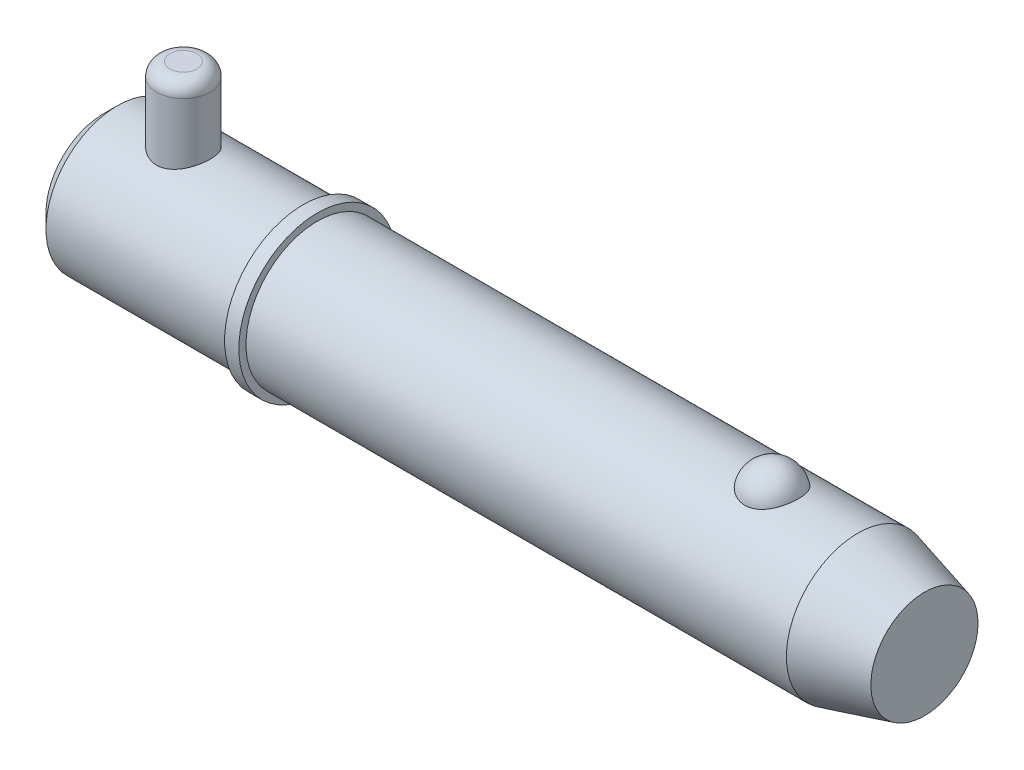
ISO-10303-21;
HEADER;
FILE_DESCRIPTION(('STEP AP214'),'2;1');
FILE_NAME('part.step','',(''),(''),'','','');
FILE_SCHEMA(('AUTOMOTIVE_DESIGN { 1 0 10303 214 1 1 1 1 }'));
ENDSEC;
DATA;
#1=APPLICATION_CONTEXT('core data for automotive mechanical design processes');
#2=APPLICATION_PROTOCOL_DEFINITION('international standard','automotive_design',2000,#1);
#3=PRODUCT_CONTEXT('',#1,'mechanical');
#4=PRODUCT('Part','Part','',(#3));
#5=PRODUCT_RELATED_PRODUCT_CATEGORY('part','',(#4));
#6=PRODUCT_DEFINITION_FORMATION('','',#4);
#7=PRODUCT_DEFINITION_CONTEXT('part definition',#1,'design');
#8=PRODUCT_DEFINITION('design','',#6,#7);
#9=PRODUCT_DEFINITION_SHAPE('','',#8);
#10=(LENGTH_UNIT() NAMED_UNIT(*) SI_UNIT(.MILLI.,.METRE.));
#11=(NAMED_UNIT(*) PLANE_ANGLE_UNIT() SI_UNIT($,.RADIAN.));
#12=(NAMED_UNIT(*) SI_UNIT($,.STERADIAN.) SOLID_ANGLE_UNIT());
#13=UNCERTAINTY_MEASURE_WITH_UNIT(LENGTH_MEASURE(1.E-05),#10,'distance_accuracy_value','');
#14=(GEOMETRIC_REPRESENTATION_CONTEXT(3) GLOBAL_UNCERTAINTY_ASSIGNED_CONTEXT((#13)) GLOBAL_UNIT_ASSIGNED_CONTEXT((#10,
#11,#12)) REPRESENTATION_CONTEXT('',''));
#15=CARTESIAN_POINT('',(0.,0.,0.));
#16=DIRECTION('',(0.,0.,1.));
#17=DIRECTION('',(1.,0.,0.));
#18=AXIS2_PLACEMENT_3D('',#15,#16,#17);
#19=CARTESIAN_POINT('',(14.28,25.4,0.));
#20=DIRECTION('',(0.,-1.,0.));
#21=DIRECTION('',(0.,0.,-1.));
#22=AXIS2_PLACEMENT_3D('',#19,#20,#21);
#23=CYLINDRICAL_SURFACE('',#22,4.76);
#24=CARTESIAN_POINT('',(14.28,-10.32,0.));
#25=DIRECTION('',(0.,1.,0.));
#26=DIRECTION('',(0.,0.,1.));
#27=AXIS2_PLACEMENT_3D('',#24,#25,#26);
#28=CIRCLE('',#27,4.76);
#29=CARTESIAN_POINT('',(14.28,-10.32,-4.76));
#30=VERTEX_POINT('',#29);
#31=EDGE_CURVE('P0_E25',#30,#30,#28,.T.);
#32=CARTESIAN_POINT('',(14.28,23.02,0.));
#33=DIRECTION('',(0.,1.,0.));
#34=DIRECTION('',(0.,0.,1.));
#35=AXIS2_PLACEMENT_3D('',#32,#33,#34);
#36=CIRCLE('',#35,4.76);
#37=CARTESIAN_POINT('',(14.28,23.02,-4.76));
#38=VERTEX_POINT('',#37);
#39=EDGE_CURVE('P0_E29',#38,#38,#36,.F.);
#40=CARTESIAN_POINT('',(14.28,-10.32,-4.76));
#41=CARTESIAN_POINT('',(14.28,-9.97270833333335,-4.76));
#42=CARTESIAN_POINT('',(14.28,-9.62541666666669,-4.76));
#43=CARTESIAN_POINT('',(14.28,-8.93083333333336,-4.76));
#44=CARTESIAN_POINT('',(14.28,-8.58354166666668,-4.76));
#45=CARTESIAN_POINT('',(14.28,-7.88895833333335,-4.76));
#46=CARTESIAN_POINT('',(14.28,-7.54166666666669,-4.76));
#47=CARTESIAN_POINT('',(14.28,-6.84708333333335,-4.76));
#48=CARTESIAN_POINT('',(14.28,-6.49979166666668,-4.76));
#49=CARTESIAN_POINT('',(14.28,-5.80520833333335,-4.76));
#50=CARTESIAN_POINT('',(14.28,-5.45791666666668,-4.76));
#51=CARTESIAN_POINT('',(14.28,-4.76333333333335,-4.76));
#52=CARTESIAN_POINT('',(14.28,-4.41604166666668,-4.76));
#53=CARTESIAN_POINT('',(14.28,-3.72145833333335,-4.76));
#54=CARTESIAN_POINT('',(14.28,-3.37416666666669,-4.76));
#55=CARTESIAN_POINT('',(14.28,-2.67958333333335,-4.76));
#56=CARTESIAN_POINT('',(14.28,-2.33229166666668,-4.76));
#57=CARTESIAN_POINT('',(14.28,-1.63770833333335,-4.76));
#58=CARTESIAN_POINT('',(14.28,-1.29041666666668,-4.76));
#59=CARTESIAN_POINT('',(14.28,-0.595833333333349,-4.76));
#60=CARTESIAN_POINT('',(14.28,-0.24854166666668,-4.76));
#61=CARTESIAN_POINT('',(14.28,0.446041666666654,-4.76));
#62=CARTESIAN_POINT('',(14.28,0.793333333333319,-4.76));
#63=CARTESIAN_POINT('',(14.28,1.48791666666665,-4.76));
#64=CARTESIAN_POINT('',(14.28,1.83520833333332,-4.76));
#65=CARTESIAN_POINT('',(14.28,2.52979166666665,-4.76));
#66=CARTESIAN_POINT('',(14.28,2.87708333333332,-4.76));
#67=CARTESIAN_POINT('',(14.28,3.57166666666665,-4.76));
#68=CARTESIAN_POINT('',(14.28,3.91895833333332,-4.76));
#69=CARTESIAN_POINT('',(14.28,4.61354166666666,-4.76));
#70=CARTESIAN_POINT('',(14.28,4.96083333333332,-4.76));
#71=CARTESIAN_POINT('',(14.28,5.65541666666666,-4.76));
#72=CARTESIAN_POINT('',(14.28,6.00270833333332,-4.76));
#73=CARTESIAN_POINT('',(14.28,6.69729166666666,-4.76));
#74=CARTESIAN_POINT('',(14.28,7.04458333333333,-4.76));
#75=CARTESIAN_POINT('',(14.28,7.73916666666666,-4.76));
#76=CARTESIAN_POINT('',(14.28,8.08645833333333,-4.76));
#77=CARTESIAN_POINT('',(14.28,8.78104166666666,-4.76));
#78=CARTESIAN_POINT('',(14.28,9.12833333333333,-4.76));
#79=CARTESIAN_POINT('',(14.28,9.82291666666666,-4.76));
#80=CARTESIAN_POINT('',(14.28,10.1702083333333,-4.76));
#81=CARTESIAN_POINT('',(14.28,10.8647916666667,-4.76));
#82=CARTESIAN_POINT('',(14.28,11.2120833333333,-4.76));
#83=CARTESIAN_POINT('',(14.28,11.9066666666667,-4.76));
#84=CARTESIAN_POINT('',(14.28,12.2539583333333,-4.76));
#85=CARTESIAN_POINT('',(14.28,12.9485416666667,-4.76));
#86=CARTESIAN_POINT('',(14.28,13.2958333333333,-4.76));
#87=CARTESIAN_POINT('',(14.28,13.9904166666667,-4.76));
#88=CARTESIAN_POINT('',(14.28,14.3377083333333,-4.76));
#89=CARTESIAN_POINT('',(14.28,15.0322916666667,-4.76));
#90=CARTESIAN_POINT('',(14.28,15.3795833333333,-4.76));
#91=CARTESIAN_POINT('',(14.28,16.0741666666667,-4.76));
#92=CARTESIAN_POINT('',(14.28,16.4214583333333,-4.76));
#93=CARTESIAN_POINT('',(14.28,17.1160416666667,-4.76));
#94=CARTESIAN_POINT('',(14.28,17.4633333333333,-4.76));
#95=CARTESIAN_POINT('',(14.28,18.1579166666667,-4.76));
#96=CARTESIAN_POINT('',(14.28,18.5052083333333,-4.76));
#97=CARTESIAN_POINT('',(14.28,19.1997916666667,-4.76));
#98=CARTESIAN_POINT('',(14.28,19.5470833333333,-4.76));
#99=CARTESIAN_POINT('',(14.28,20.2416666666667,-4.76));
#100=CARTESIAN_POINT('',(14.28,20.5889583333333,-4.76));
#101=CARTESIAN_POINT('',(14.28,21.2835416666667,-4.76));
#102=CARTESIAN_POINT('',(14.28,21.6308333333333,-4.76));
#103=CARTESIAN_POINT('',(14.28,22.3254166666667,-4.76));
#104=CARTESIAN_POINT('',(14.28,22.6727083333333,-4.76));
#105=CARTESIAN_POINT('',(14.28,23.02,-4.76));
#106=B_SPLINE_CURVE_WITH_KNOTS('',3,(#40,#41,#42,#43,#44,#45,#46,#47,#48,#49,#50,#51,#52,#53,
#54,#55,#56,#57,#58,#59,#60,#61,#62,#63,#64,#65,#66,#67,#68,#69,#70,#71,#72,#73,#74,#75,#76,#77,
#78,#79,#80,#81,#82,#83,#84,#85,#86,#87,#88,#89,#90,#91,#92,#93,#94,#95,#96,#97,#98,#99,#100,
#101,#102,#103,#104,#105),.UNSPECIFIED.,.F.,.F.,(4,2,2,2,2,2,2,2,2,2,2,2,2,2,2,2,2,2,2,2,2,2,2,
2,2,2,2,2,2,2,2,2,4),(0.,1.041875,2.08375,3.125625,4.1675,5.209375,6.25125,7.293125,
8.33500000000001,9.376875,10.41875,11.460625,12.5025,13.544375,14.58625,15.628125,16.67,
17.711875,18.75375,19.795625,20.8375,21.879375,22.92125,23.963125,25.005,26.046875,27.08875,
28.130625,29.1725,30.214375,31.25625,32.298125,33.34),.UNSPECIFIED.);
#107=EDGE_CURVE('P0_BSEAM14',#30,#38,#106,.T.);
#108=ORIENTED_EDGE('',*,*,#31,.T.);
#109=ORIENTED_EDGE('',*,*,#39,.T.);
#110=ORIENTED_EDGE('',*,*,#107,.T.);
#111=ORIENTED_EDGE('',*,*,#107,.F.);
#112=EDGE_LOOP('',(#108,#110,#109,#111));
#113=FACE_BOUND('',#112,.T.);
#114=ADVANCED_FACE('P0_F14',(#113),#23,.T.);
#115=CARTESIAN_POINT('',(14.28,25.4,0.));
#116=DIRECTION('',(0.,1.,0.));
#117=DIRECTION('',(0.,0.,1.));
#118=AXIS2_PLACEMENT_3D('',#115,#116,#117);
#119=PLANE('',#118);
#120=CARTESIAN_POINT('',(14.28,25.4,0.));
#121=DIRECTION('',(0.,1.,0.));
#122=DIRECTION('',(0.,0.,1.));
#123=AXIS2_PLACEMENT_3D('',#120,#121,#122);
#124=CIRCLE('',#123,2.38);
#125=CARTESIAN_POINT('',(14.28,25.4,2.38));
#126=VERTEX_POINT('',#125);
#127=EDGE_CURVE('P0_E10',#126,#126,#124,.T.);
#128=ORIENTED_EDGE('',*,*,#127,.T.);
#129=EDGE_LOOP('',(#128));
#130=FACE_BOUND('',#129,.T.);
#131=ADVANCED_FACE('P0_F46',(#130),#119,.T.);
#132=CARTESIAN_POINT('',(14.28,-12.7,0.));
#133=DIRECTION('',(0.,1.,0.));
#134=DIRECTION('',(0.,0.,1.));
#135=AXIS2_PLACEMENT_3D('',#132,#133,#134);
#136=PLANE('',#135);
#137=CARTESIAN_POINT('',(14.28,-12.7,0.));
#138=DIRECTION('',(0.,1.,0.));
#139=DIRECTION('',(0.,0.,1.));
#140=AXIS2_PLACEMENT_3D('',#137,#138,#139);
#141=CIRCLE('',#140,2.38);
#142=CARTESIAN_POINT('',(14.28,-12.7,2.38));
#143=VERTEX_POINT('',#142);
#144=EDGE_CURVE('P0_E21',#143,#143,#141,.F.);
#145=ORIENTED_EDGE('',*,*,#144,.T.);
#146=EDGE_LOOP('',(#145));
#147=FACE_BOUND('',#146,.T.);
#148=ADVANCED_FACE('P0_F43',(#147),#136,.F.);
#149=CARTESIAN_POINT('',(14.28,-10.32,0.));
#150=DIRECTION('',(0.,1.,0.));
#151=DIRECTION('',(0.,0.,1.));
#152=AXIS2_PLACEMENT_3D('',#149,#150,#151);
#153=DEGENERATE_TOROIDAL_SURFACE('',#152,2.38,2.38,.T.);
#154=ORIENTED_EDGE('',*,*,#144,.F.);
#155=EDGE_LOOP('',(#154));
#156=FACE_BOUND('',#155,.T.);
#157=ORIENTED_EDGE('',*,*,#31,.F.);
#158=EDGE_LOOP('',(#157));
#159=FACE_BOUND('',#158,.T.);
#160=ADVANCED_FACE('P0_F38',(#156,#159),#153,.T.);
#161=CARTESIAN_POINT('',(14.28,23.02,0.));
#162=DIRECTION('',(0.,1.,0.));
#163=DIRECTION('',(0.,0.,1.));
#164=AXIS2_PLACEMENT_3D('',#161,#162,#163);
#165=DEGENERATE_TOROIDAL_SURFACE('',#164,2.38,2.38,.T.);
#166=ORIENTED_EDGE('',*,*,#39,.F.);
#167=EDGE_LOOP('',(#166));
#168=FACE_BOUND('',#167,.T.);
#169=ORIENTED_EDGE('',*,*,#127,.F.);
#170=EDGE_LOOP('',(#169));
#171=FACE_BOUND('',#170,.T.);
#172=ADVANCED_FACE('P0_F16',(#168,#171),#165,.T.);
#173=CLOSED_SHELL('',(#114,#131,#148,#160,#172));
#174=MANIFOLD_SOLID_BREP('P0_B1',#173);
#175=CARTESIAN_POINT('',(0.,0.,0.));
#176=DIRECTION('',(1.,0.,0.));
#177=DIRECTION('',(0.,0.,-1.));
#178=AXIS2_PLACEMENT_3D('',#175,#176,#177);
#179=CYLINDRICAL_SURFACE('',#178,12.7);
#180=CARTESIAN_POINT('',(134.200738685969,0.,0.));
#181=DIRECTION('',(1.,0.,0.));
#182=DIRECTION('',(0.,0.,-1.));
#183=AXIS2_PLACEMENT_3D('',#180,#181,#182);
#184=CIRCLE('',#183,12.7);
#185=CARTESIAN_POINT('',(134.200738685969,0.,-12.7));
#186=VERTEX_POINT('',#185);
#187=EDGE_CURVE('P1_E81',#186,#186,#184,.T.);
#188=ORIENTED_EDGE('',*,*,#187,.F.);
#189=EDGE_LOOP('',(#188));
#190=FACE_BOUND('',#189,.T.);
#191=CARTESIAN_POINT('',(38.1,0.,0.));
#192=DIRECTION('',(1.,0.,0.));
#193=DIRECTION('',(0.,0.,-1.));
#194=AXIS2_PLACEMENT_3D('',#191,#192,#193);
#195=CIRCLE('',#194,12.7);
#196=CARTESIAN_POINT('',(38.1,0.,-12.7));
#197=VERTEX_POINT('',#196);
#198=EDGE_CURVE('P1_E85',#197,#197,#195,.T.);
#199=ORIENTED_EDGE('',*,*,#198,.T.);
#200=EDGE_LOOP('',(#199));
#201=FACE_BOUND('',#200,.T.);
#202=CARTESIAN_POINT('',(118.960042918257,11.7500437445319,4.81938502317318));
#203=CARTESIAN_POINT('',(118.835088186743,11.7500430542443,4.81938571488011));
#204=CARTESIAN_POINT('',(118.710144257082,11.7520975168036,4.81438658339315));
#205=CARTESIAN_POINT('',(118.461142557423,11.760253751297,4.79442904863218));
#206=CARTESIAN_POINT('',(118.337085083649,11.7663568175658,4.77946746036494));
#207=CARTESIAN_POINT('',(118.090901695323,11.7824262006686,4.7397141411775));
#208=CARTESIAN_POINT('',(117.968774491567,11.7923898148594,4.71492928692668));
#209=CARTESIAN_POINT('',(117.727187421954,11.8158938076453,4.65571340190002));
#210=CARTESIAN_POINT('',(117.60772859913,11.8294355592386,4.6212786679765));
#211=CARTESIAN_POINT('',(117.372557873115,11.8596812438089,4.54309502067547));
#212=CARTESIAN_POINT('',(117.256839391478,11.8763792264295,4.49936361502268));
#213=CARTESIAN_POINT('',(117.029653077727,11.9124878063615,4.40287235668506));
#214=CARTESIAN_POINT('',(116.918186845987,11.9318994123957,4.35010914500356));
#215=CARTESIAN_POINT('',(116.591278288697,11.9934256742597,4.17881316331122));
#216=CARTESIAN_POINT('',(116.383127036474,12.038858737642,4.04720756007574));
#217=CARTESIAN_POINT('',(115.985850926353,12.1352173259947,3.748564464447));
#218=CARTESIAN_POINT('',(115.797443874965,12.1862630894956,3.58061821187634));
#219=CARTESIAN_POINT('',(115.450521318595,12.2875163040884,3.21600758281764));
#220=CARTESIAN_POINT('',(115.292011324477,12.3377235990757,3.0193379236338));
#221=CARTESIAN_POINT('',(115.00168878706,12.434492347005,2.592916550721));
#222=CARTESIAN_POINT('',(114.871376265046,12.4807925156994,2.36208286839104));
#223=CARTESIAN_POINT('',(114.649407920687,12.5623454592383,1.88070399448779));
#224=CARTESIAN_POINT('',(114.557755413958,12.5975972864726,1.63015711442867));
#225=CARTESIAN_POINT('',(114.414046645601,12.6538414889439,1.1129886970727));
#226=CARTESIAN_POINT('',(114.362499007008,12.6746503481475,0.846205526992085));
#227=CARTESIAN_POINT('',(114.301977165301,12.699153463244,0.307085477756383));
#228=CARTESIAN_POINT('',(114.293001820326,12.7028481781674,0.0347487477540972));
#229=CARTESIAN_POINT('',(114.317731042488,12.6927785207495,-0.506073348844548));
#230=CARTESIAN_POINT('',(114.351189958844,12.6791146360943,-0.77457186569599));
#231=CARTESIAN_POINT('',(114.459687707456,12.635882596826,-1.30170246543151));
#232=CARTESIAN_POINT('',(114.53472729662,12.606314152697,-1.5603343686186));
#233=CARTESIAN_POINT('',(114.72500006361,12.5342328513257,-2.06083899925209));
#234=CARTESIAN_POINT('',(114.840287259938,12.4917026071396,-2.3026886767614));
#235=CARTESIAN_POINT('',(115.108704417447,12.3981123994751,-2.76259600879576));
#236=CARTESIAN_POINT('',(115.261837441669,12.3470517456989,-2.98065173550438));
#237=CARTESIAN_POINT('',(115.603507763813,12.2416045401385,-3.38786328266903));
#238=CARTESIAN_POINT('',(115.792201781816,12.1872040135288,-3.57688418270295));
#239=CARTESIAN_POINT('',(116.200239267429,12.0814086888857,-3.91941073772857));
#240=CARTESIAN_POINT('',(116.419580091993,12.0300136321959,-4.07291945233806));
#241=CARTESIAN_POINT('',(116.878375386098,11.9373542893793,-4.33691289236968));
#242=CARTESIAN_POINT('',(117.117304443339,11.8958982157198,-4.44824125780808));
#243=CARTESIAN_POINT('',(117.61243761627,11.8268116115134,-4.62881985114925));
#244=CARTESIAN_POINT('',(117.868635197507,11.7991758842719,-4.69808589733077));
#245=CARTESIAN_POINT('',(118.377164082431,11.7622209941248,-4.78983181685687));
#246=CARTESIAN_POINT('',(118.629041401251,11.7520502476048,-4.81449025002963));
#247=CARTESIAN_POINT('',(119.133573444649,11.7485796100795,-4.82295735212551));
#248=CARTESIAN_POINT('',(119.386228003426,11.7552763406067,-4.80677420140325));
#249=CARTESIAN_POINT('',(119.876834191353,11.7842584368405,-4.73525430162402));
#250=CARTESIAN_POINT('',(120.114998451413,11.8060486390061,-4.68116061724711));
#251=CARTESIAN_POINT('',(120.578489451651,11.8622750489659,-4.53678133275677));
#252=CARTESIAN_POINT('',(120.803815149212,11.8967122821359,-4.44649279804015));
#253=CARTESIAN_POINT('',(121.240801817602,11.9754603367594,-4.2298761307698));
#254=CARTESIAN_POINT('',(121.452057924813,12.0199699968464,-4.10280539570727));
#255=CARTESIAN_POINT('',(121.850601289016,12.1138028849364,-3.81685409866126));
#256=CARTESIAN_POINT('',(122.037883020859,12.163127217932,-3.65796622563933));
#257=CARTESIAN_POINT('',(122.393350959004,12.2642343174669,-3.30364864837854));
#258=CARTESIAN_POINT('',(122.560111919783,12.3160165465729,-3.10678783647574));
#259=CARTESIAN_POINT('',(122.859579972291,12.4142566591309,-2.68748409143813));
#260=CARTESIAN_POINT('',(122.992280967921,12.4607135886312,-2.46503658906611));
#261=CARTESIAN_POINT('',(123.224691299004,12.5450236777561,-1.99289519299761));
#262=CARTESIAN_POINT('',(123.323215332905,12.5825557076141,-1.74255918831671));
#263=CARTESIAN_POINT('',(123.479227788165,12.6431720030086,-1.22773734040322));
#264=CARTESIAN_POINT('',(123.536715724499,12.6662560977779,-0.963251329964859));
#265=CARTESIAN_POINT('',(123.609544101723,12.6956486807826,-0.427355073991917));
#266=CARTESIAN_POINT('',(123.624837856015,12.7019385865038,-0.1559374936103));
#267=CARTESIAN_POINT('',(123.612779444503,12.6970201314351,0.385928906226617));
#268=CARTESIAN_POINT('',(123.58542805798,12.6858120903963,0.656377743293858));
#269=CARTESIAN_POINT('',(123.513060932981,12.6568455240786,1.05454017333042));
#270=CARTESIAN_POINT('',(123.483796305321,12.6451962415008,1.18577850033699));
#271=CARTESIAN_POINT('',(123.415022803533,12.6181819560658,1.4451380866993));
#272=CARTESIAN_POINT('',(123.375517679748,12.6028183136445,1.57326046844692));
#273=CARTESIAN_POINT('',(123.286439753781,12.5687547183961,1.82554978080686));
#274=CARTESIAN_POINT('',(123.236862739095,12.5500533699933,1.9497150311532));
#275=CARTESIAN_POINT('',(123.12792115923,12.5098093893,2.1931437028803));
#276=CARTESIAN_POINT('',(123.068560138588,12.4882677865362,2.31240887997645));
#277=CARTESIAN_POINT('',(122.93997128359,12.4427679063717,2.54593031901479));
#278=CARTESIAN_POINT('',(122.870688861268,12.4187964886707,2.66015396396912));
#279=CARTESIAN_POINT('',(122.722903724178,12.3691892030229,2.88202659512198));
#280=CARTESIAN_POINT('',(122.644404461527,12.3435539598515,2.98967802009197));
#281=CARTESIAN_POINT('',(122.478550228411,12.2912955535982,3.19774385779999));
#282=CARTESIAN_POINT('',(122.391191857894,12.2646720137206,3.29815546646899));
#283=CARTESIAN_POINT('',(122.208161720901,12.2111945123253,3.49095035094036));
#284=CARTESIAN_POINT('',(122.112493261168,12.1843406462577,3.58333679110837));
#285=CARTESIAN_POINT('',(121.913627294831,12.1312249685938,3.75922876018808));
#286=CARTESIAN_POINT('',(121.810450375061,12.104961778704,3.84275713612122));
#287=CARTESIAN_POINT('',(121.59701336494,12.0537284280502,4.00056406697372));
#288=CARTESIAN_POINT('',(121.486756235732,12.028757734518,4.07484645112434));
#289=CARTESIAN_POINT('',(121.259755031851,11.9808306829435,4.21367959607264));
#290=CARTESIAN_POINT('',(121.143006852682,11.9578756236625,4.27822410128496));
#291=CARTESIAN_POINT('',(120.90394258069,11.9147184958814,4.39698483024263));
#292=CARTESIAN_POINT('',(120.781628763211,11.894515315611,4.45120522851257));
#293=CARTESIAN_POINT('',(120.522952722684,11.8561129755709,4.55255353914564));
#294=CARTESIAN_POINT('',(120.386223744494,11.8381764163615,4.59884858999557));
#295=CARTESIAN_POINT('',(120.108608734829,11.8069093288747,4.67853897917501));
#296=CARTESIAN_POINT('',(119.967724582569,11.7935767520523,4.71194005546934));
#297=CARTESIAN_POINT('',(119.68309446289,11.7720277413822,4.76552188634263));
#298=CARTESIAN_POINT('',(119.539348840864,11.7638106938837,4.78570422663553));
#299=CARTESIAN_POINT('',(119.250411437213,11.7528195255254,4.81263433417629));
#300=CARTESIAN_POINT('',(119.105219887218,11.7500445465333,4.81938421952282));
#301=CARTESIAN_POINT('',(118.960042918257,11.7500437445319,4.81938502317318));
#302=B_SPLINE_CURVE_WITH_KNOTS('',3,(#202,#203,#204,#205,#206,#207,#208,#209,#210,#211,#212,
#213,#214,#215,#216,#217,#218,#219,#220,#221,#222,#223,#224,#225,#226,#227,#228,#229,#230,#231,
#232,#233,#234,#235,#236,#237,#238,#239,#240,#241,#242,#243,#244,#245,#246,#247,#248,#249,#250,
#251,#252,#253,#254,#255,#256,#257,#258,#259,#260,#261,#262,#263,#264,#265,#266,#267,#268,#269,
#270,#271,#272,#273,#274,#275,#276,#277,#278,#279,#280,#281,#282,#283,#284,#285,#286,#287,#288,
#289,#290,#291,#292,#293,#294,#295,#296,#297,#298,#299,#300,#301),.UNSPECIFIED.,.T.,.F.,(4,2,2,
2,2,2,2,2,2,2,2,2,2,2,2,2,2,2,2,2,2,2,2,2,2,2,2,2,2,2,2,2,2,2,2,2,2,2,2,2,2,2,2,2,2,2,2,2,2,4),
(0.,0.374729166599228,0.749578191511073,1.12416526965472,1.49889629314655,1.87292776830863,
2.24709865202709,2.99481328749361,3.76399449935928,4.53331735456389,5.3368391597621,
6.14042986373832,6.95405296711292,7.76765424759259,8.57656703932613,9.38549455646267,
10.1955119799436,11.0055949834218,11.8193353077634,12.6330054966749,13.4294141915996,
14.2255231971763,14.9815786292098,15.7374826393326,16.4696948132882,17.2019663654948,
17.9501979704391,18.6986017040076,19.484470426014,20.2704797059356,21.0815215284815,
21.8925729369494,22.7045213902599,23.5164550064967,23.9209608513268,24.3253187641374,
24.7298461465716,25.1342272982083,25.54092555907,25.9474719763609,26.3541750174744,
26.7607169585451,27.1661834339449,27.5714814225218,27.9770386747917,28.3824315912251,
28.8181206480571,29.2536155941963,29.6890582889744,30.1244323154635),.UNSPECIFIED.);
#303=CARTESIAN_POINT('',(118.960042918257,11.7500437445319,4.81938502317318));
#304=VERTEX_POINT('',#303);
#305=EDGE_CURVE('P1_E35',#304,#304,#302,.T.);
#306=ORIENTED_EDGE('',*,*,#305,.T.);
#307=EDGE_LOOP('',(#306));
#308=FACE_BOUND('',#307,.T.);
#309=ADVANCED_FACE('P1_F13',(#190,#201,#308),#179,.T.);
#310=CARTESIAN_POINT('',(0.,0.,0.));
#311=DIRECTION('',(-1.,0.,0.));
#312=DIRECTION('',(0.,0.,1.));
#313=AXIS2_PLACEMENT_3D('',#310,#311,#312);
#314=PLANE('',#313);
#315=CARTESIAN_POINT('',(0.,0.,0.));
#316=DIRECTION('',(1.,0.,0.));
#317=DIRECTION('',(0.,0.,-1.));
#318=AXIS2_PLACEMENT_3D('',#315,#316,#317);
#319=CIRCLE('',#318,10.16);
#320=CARTESIAN_POINT('',(0.,0.,-10.16));
#321=VERTEX_POINT('',#320);
#322=EDGE_CURVE('P1_E9',#321,#321,#319,.T.);
#323=ORIENTED_EDGE('',*,*,#322,.F.);
#324=EDGE_LOOP('',(#323));
#325=FACE_BOUND('',#324,.T.);
#326=ADVANCED_FACE('P1_F15',(#325),#314,.T.);
#327=CARTESIAN_POINT('',(2.53999999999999,0.,0.));
#328=DIRECTION('',(1.,0.,0.));
#329=DIRECTION('',(0.,0.,-1.));
#330=AXIS2_PLACEMENT_3D('',#327,#328,#329);
#331=CONICAL_SURFACE('',#330,12.7,0.78539816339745);
#332=ORIENTED_EDGE('',*,*,#322,.T.);
#333=EDGE_LOOP('',(#332));
#334=FACE_BOUND('',#333,.T.);
#335=CARTESIAN_POINT('',(2.53999999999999,0.,0.));
#336=DIRECTION('',(1.,0.,0.));
#337=DIRECTION('',(0.,0.,-1.));
#338=AXIS2_PLACEMENT_3D('',#335,#336,#337);
#339=CIRCLE('',#338,12.7);
#340=CARTESIAN_POINT('',(2.53999999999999,0.,-12.7));
#341=VERTEX_POINT('',#340);
#342=EDGE_CURVE('P1_E26',#341,#341,#339,.T.);
#343=ORIENTED_EDGE('',*,*,#342,.F.);
#344=EDGE_LOOP('',(#343));
#345=FACE_BOUND('',#344,.T.);
#346=ADVANCED_FACE('P1_F77',(#334,#345),#331,.T.);
#347=CARTESIAN_POINT('',(0.,0.,0.));
#348=DIRECTION('',(1.,0.,0.));
#349=DIRECTION('',(0.,0.,-1.));
#350=AXIS2_PLACEMENT_3D('',#347,#348,#349);
#351=CYLINDRICAL_SURFACE('',#350,12.7);
#352=CARTESIAN_POINT('',(14.28,-11.7742260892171,4.76));
#353=CARTESIAN_POINT('',(14.1514948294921,-11.7742255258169,4.76000061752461));
#354=CARTESIAN_POINT('',(14.0229980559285,-11.7763355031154,4.75479194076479));
#355=CARTESIAN_POINT('',(13.7669369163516,-11.7847043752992,4.73401198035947));
#356=CARTESIAN_POINT('',(13.6393728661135,-11.7909646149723,4.71843733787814));
#357=CARTESIAN_POINT('',(13.386226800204,-11.8074248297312,4.67709434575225));
#358=CARTESIAN_POINT('',(13.2606439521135,-11.8176231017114,4.65133040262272));
#359=CARTESIAN_POINT('',(13.0122434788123,-11.8416347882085,4.58985545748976));
#360=CARTESIAN_POINT('',(12.8894269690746,-11.8554496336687,4.55414051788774));
#361=CARTESIAN_POINT('',(12.6477622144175,-11.8862222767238,4.47320764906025));
#362=CARTESIAN_POINT('',(12.5289037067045,-11.9031710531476,4.4280169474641));
#363=CARTESIAN_POINT('',(12.2955059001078,-11.939736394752,4.32845291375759));
#364=CARTESIAN_POINT('',(12.1809682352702,-11.9593539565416,4.2740761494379));
#365=CARTESIAN_POINT('',(11.8448901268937,-12.0213893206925,4.09777237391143));
#366=CARTESIAN_POINT('',(11.6307077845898,-12.0670135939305,3.9626122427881));
#367=CARTESIAN_POINT('',(11.2179129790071,-12.1641514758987,3.65386230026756));
#368=CARTESIAN_POINT('',(11.0204399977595,-12.2158379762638,3.47881300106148));
#369=CARTESIAN_POINT('',(10.6568212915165,-12.3178468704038,3.09829182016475));
#370=CARTESIAN_POINT('',(10.4906822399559,-12.3681689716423,2.89281347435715));
#371=CARTESIAN_POINT('',(10.1890299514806,-12.4638367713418,2.44867909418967));
#372=CARTESIAN_POINT('',(10.054749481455,-12.5089552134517,2.20913281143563));
#373=CARTESIAN_POINT('',(9.82886079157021,-12.5870472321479,1.70885919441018));
#374=CARTESIAN_POINT('',(9.73723778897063,-12.620025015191,1.44813923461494));
#375=CARTESIAN_POINT('',(9.60324488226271,-12.6688874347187,0.9248423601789));
#376=CARTESIAN_POINT('',(9.55892269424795,-12.6854474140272,0.662829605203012));
#377=CARTESIAN_POINT('',(9.5145335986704,-12.7020320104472,0.134596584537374));
#378=CARTESIAN_POINT('',(9.5144523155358,-12.7020619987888,-0.131622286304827));
#379=CARTESIAN_POINT('',(9.55741019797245,-12.6860129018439,-0.646717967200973));
#380=CARTESIAN_POINT('',(9.59831845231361,-12.6707298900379,-0.895801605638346));
#381=CARTESIAN_POINT('',(9.71850987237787,-12.6268158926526,-1.38327219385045));
#382=CARTESIAN_POINT('',(9.79779575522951,-12.5981839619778,-1.62165838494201));
#383=CARTESIAN_POINT('',(9.99348296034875,-12.5298894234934,-2.08508424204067));
#384=CARTESIAN_POINT('',(10.110407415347,-12.4900724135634,-2.30987931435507));
#385=CARTESIAN_POINT('',(10.3775896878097,-12.4034373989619,-2.7372158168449));
#386=CARTESIAN_POINT('',(10.5278582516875,-12.3566171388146,-2.93975004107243));
#387=CARTESIAN_POINT('',(10.8677318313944,-12.257571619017,-3.32936830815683));
#388=CARTESIAN_POINT('',(11.0591227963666,-12.2051903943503,-3.51485714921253));
#389=CARTESIAN_POINT('',(11.4706087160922,-12.1031155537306,-3.85170663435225));
#390=CARTESIAN_POINT('',(11.6907108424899,-12.0534226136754,-4.00305872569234));
#391=CARTESIAN_POINT('',(12.1596597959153,-11.9613684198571,-4.27038218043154));
#392=CARTESIAN_POINT('',(12.4090353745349,-11.9191939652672,-4.38549550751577));
#393=CARTESIAN_POINT('',(12.9256290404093,-11.8491124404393,-4.57149117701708));
#394=CARTESIAN_POINT('',(13.1928371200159,-11.8211974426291,-4.64239810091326));
#395=CARTESIAN_POINT('',(13.7217488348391,-11.7846654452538,-4.73434137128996));
#396=CARTESIAN_POINT('',(13.9829438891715,-11.7750694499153,-4.75791141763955));
#397=CARTESIAN_POINT('',(14.5056760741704,-11.7734909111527,-4.76182097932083));
#398=CARTESIAN_POINT('',(14.7672131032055,-11.7815039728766,-4.74217128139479));
#399=CARTESIAN_POINT('',(15.2702140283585,-11.8132466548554,-4.66249544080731));
#400=CARTESIAN_POINT('',(15.5120417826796,-11.8362133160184,-4.60442726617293));
#401=CARTESIAN_POINT('',(15.9824097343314,-11.8943704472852,-4.45202868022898));
#402=CARTESIAN_POINT('',(16.2109472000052,-11.9295634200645,-4.35769084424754));
#403=CARTESIAN_POINT('',(16.6577741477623,-12.0098310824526,-4.13144368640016));
#404=CARTESIAN_POINT('',(16.8753590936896,-12.055226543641,-3.99825937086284));
#405=CARTESIAN_POINT('',(17.2859732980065,-12.150238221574,-3.69949845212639));
#406=CARTESIAN_POINT('',(17.4789935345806,-12.19985597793,-3.5339100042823));
#407=CARTESIAN_POINT('',(17.8477707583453,-12.3015434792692,-3.1624728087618));
#408=CARTESIAN_POINT('',(18.0216609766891,-12.3535695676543,-2.95473880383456));
#409=CARTESIAN_POINT('',(18.254545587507,-12.426745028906,-2.62277433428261));
#410=CARTESIAN_POINT('',(18.3275489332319,-12.4503382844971,-2.50865480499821));
#411=CARTESIAN_POINT('',(18.463723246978,-12.4952713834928,-2.27428971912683));
#412=CARTESIAN_POINT('',(18.5268984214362,-12.5166121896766,-2.15404681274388));
#413=CARTESIAN_POINT('',(18.6427140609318,-12.5563817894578,-1.90858448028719));
#414=CARTESIAN_POINT('',(18.6953855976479,-12.5748191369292,-1.78338108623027));
#415=CARTESIAN_POINT('',(18.7899337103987,-12.6083284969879,-1.52857834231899));
#416=CARTESIAN_POINT('',(18.8318147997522,-12.6234019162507,-1.39898085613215));
#417=CARTESIAN_POINT('',(18.9043819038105,-12.6497495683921,-1.13633254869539));
#418=CARTESIAN_POINT('',(18.9350698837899,-12.6610244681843,-1.00328233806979));
#419=CARTESIAN_POINT('',(18.9849303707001,-12.6794412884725,-0.734761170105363));
#420=CARTESIAN_POINT('',(19.0041035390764,-12.6865834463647,-0.59929035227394));
#421=CARTESIAN_POINT('',(19.0299427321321,-12.6962286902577,-0.335006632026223));
#422=CARTESIAN_POINT('',(19.0372742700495,-12.698978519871,-0.206267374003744));
#423=CARTESIAN_POINT('',(19.0414668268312,-12.7005496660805,0.0514515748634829));
#424=CARTESIAN_POINT('',(19.038324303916,-12.69936965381,0.180431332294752));
#425=CARTESIAN_POINT('',(19.0215965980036,-12.6931114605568,0.437551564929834));
#426=CARTESIAN_POINT('',(19.0080165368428,-12.6880351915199,0.565692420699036));
#427=CARTESIAN_POINT('',(18.9705519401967,-12.6741222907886,0.820297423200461));
#428=CARTESIAN_POINT('',(18.9466635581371,-12.665284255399,0.946760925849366));
#429=CARTESIAN_POINT('',(18.8895279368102,-12.6443449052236,1.19395899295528));
#430=CARTESIAN_POINT('',(18.8565273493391,-12.6323299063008,1.3147578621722));
#431=CARTESIAN_POINT('',(18.781239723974,-12.6052503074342,1.55308888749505));
#432=CARTESIAN_POINT('',(18.738949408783,-12.5901846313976,1.67061987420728));
#433=CARTESIAN_POINT('',(18.5986461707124,-12.5409473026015,2.01714406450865));
#434=CARTESIAN_POINT('',(18.4871532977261,-12.502717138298,2.24027279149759));
#435=CARTESIAN_POINT('',(18.2262440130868,-12.4173042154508,2.6742599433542));
#436=CARTESIAN_POINT('',(18.0754310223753,-12.3698127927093,2.88420891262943));
#437=CARTESIAN_POINT('',(17.7421836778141,-12.271667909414,3.27675114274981));
#438=CARTESIAN_POINT('',(17.5597380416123,-12.2210133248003,3.45933459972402));
#439=CARTESIAN_POINT('',(17.2605468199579,-12.1452079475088,3.7138066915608));
#440=CARTESIAN_POINT('',(17.1535518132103,-12.119328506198,3.79719993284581));
#441=CARTESIAN_POINT('',(16.9326449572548,-12.0688597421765,3.95467398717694));
#442=CARTESIAN_POINT('',(16.8187356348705,-12.0442699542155,4.02875817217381));
#443=CARTESIAN_POINT('',(16.5846234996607,-11.9971053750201,4.16711104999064));
#444=CARTESIAN_POINT('',(16.4644172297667,-11.9745317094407,4.23137427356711));
#445=CARTESIAN_POINT('',(16.2185866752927,-11.9321360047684,4.34949041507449));
#446=CARTESIAN_POINT('',(16.09296473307,-11.9123127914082,4.40334777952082));
#447=CARTESIAN_POINT('',(15.8314769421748,-11.875268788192,4.50232278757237));
#448=CARTESIAN_POINT('',(15.6954035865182,-11.8582009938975,4.54695127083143));
#449=CARTESIAN_POINT('',(15.4194002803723,-11.8284328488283,4.62383807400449));
#450=CARTESIAN_POINT('',(15.2794720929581,-11.815730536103,4.6561019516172));
#451=CARTESIAN_POINT('',(14.9969657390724,-11.7951940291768,4.70788444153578));
#452=CARTESIAN_POINT('',(14.8543884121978,-11.7873583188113,4.72740702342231));
#453=CARTESIAN_POINT('',(14.5678704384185,-11.7768749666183,4.75346370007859));
#454=CARTESIAN_POINT('',(14.4239299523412,-11.7742267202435,4.75999930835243));
#455=CARTESIAN_POINT('',(14.28,-11.7742260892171,4.76));
#456=B_SPLINE_CURVE_WITH_KNOTS('',3,(#352,#353,#354,#355,#356,#357,#358,#359,#360,#361,#362,
#363,#364,#365,#366,#367,#368,#369,#370,#371,#372,#373,#374,#375,#376,#377,#378,#379,#380,#381,
#382,#383,#384,#385,#386,#387,#388,#389,#390,#391,#392,#393,#394,#395,#396,#397,#398,#399,#400,
#401,#402,#403,#404,#405,#406,#407,#408,#409,#410,#411,#412,#413,#414,#415,#416,#417,#418,#419,
#420,#421,#422,#423,#424,#425,#426,#427,#428,#429,#430,#431,#432,#433,#434,#435,#436,#437,#438,
#439,#440,#441,#442,#443,#444,#445,#446,#447,#448,#449,#450,#451,#452,#453,#454,#455),
.UNSPECIFIED.,.T.,.F.,(4,2,2,2,2,2,2,2,2,2,2,2,2,2,2,2,2,2,2,2,2,2,2,2,2,2,2,2,2,2,2,2,2,2,2,2,
2,2,2,2,2,2,2,2,2,2,2,2,2,2,2,4),(0.,0.385378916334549,0.770882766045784,1.15622008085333,
1.54171009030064,1.92610725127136,2.31064835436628,3.07917291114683,3.88239385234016,
4.68578566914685,5.51648193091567,6.34689010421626,7.14151420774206,7.93588010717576,
8.69098665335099,9.44614666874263,10.2122918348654,10.9786842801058,11.789876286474,
12.6012713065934,13.4306405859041,14.2595482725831,15.0427613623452,15.8257790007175,
16.5716820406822,17.3177378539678,18.0917395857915,18.8660247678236,19.6893332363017,
20.1014571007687,20.5134040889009,20.9241137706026,21.3346513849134,21.7451168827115,
22.1555587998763,22.542011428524,22.928594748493,23.3149884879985,23.7015265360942,
24.0784835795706,24.4555738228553,25.2091300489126,25.994347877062,26.7798463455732,
27.1937428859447,27.6074890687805,28.0214648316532,28.4352633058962,28.8672794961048,
29.299101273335,29.7307884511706,30.1624253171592),.UNSPECIFIED.);
#457=CARTESIAN_POINT('',(14.28,-11.7742260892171,4.76));
#458=VERTEX_POINT('',#457);
#459=EDGE_CURVE('P1_E17',#458,#458,#456,.T.);
#460=ORIENTED_EDGE('',*,*,#459,.F.);
#461=EDGE_LOOP('',(#460));
#462=FACE_BOUND('',#461,.T.);
#463=CARTESIAN_POINT('',(14.28,11.7742260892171,4.76));
#464=CARTESIAN_POINT('',(14.4085051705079,11.7742255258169,4.76000061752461));
#465=CARTESIAN_POINT('',(14.5370019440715,11.7763355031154,4.75479194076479));
#466=CARTESIAN_POINT('',(14.7930630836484,11.7847043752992,4.73401198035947));
#467=CARTESIAN_POINT('',(14.9206271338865,11.7909646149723,4.71843733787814));
#468=CARTESIAN_POINT('',(15.173773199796,11.8074248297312,4.67709434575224));
#469=CARTESIAN_POINT('',(15.2993560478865,11.8176231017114,4.65133040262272));
#470=CARTESIAN_POINT('',(15.5477565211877,11.8416347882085,4.58985545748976));
#471=CARTESIAN_POINT('',(15.6705730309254,11.8554496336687,4.55414051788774));
#472=CARTESIAN_POINT('',(15.9122377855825,11.8862222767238,4.47320764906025));
#473=CARTESIAN_POINT('',(16.0310962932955,11.9031710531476,4.4280169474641));
#474=CARTESIAN_POINT('',(16.2644940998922,11.939736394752,4.32845291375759));
#475=CARTESIAN_POINT('',(16.3790317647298,11.9593539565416,4.2740761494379));
#476=CARTESIAN_POINT('',(16.7151098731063,12.0213893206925,4.09777237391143));
#477=CARTESIAN_POINT('',(16.9292922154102,12.0670135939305,3.96261224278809));
#478=CARTESIAN_POINT('',(17.3420870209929,12.1641514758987,3.65386230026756));
#479=CARTESIAN_POINT('',(17.5395600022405,12.2158379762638,3.47881300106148));
#480=CARTESIAN_POINT('',(17.9031787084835,12.3178468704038,3.09829182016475));
#481=CARTESIAN_POINT('',(18.0693177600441,12.3681689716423,2.89281347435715));
#482=CARTESIAN_POINT('',(18.3709700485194,12.4638367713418,2.44867909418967));
#483=CARTESIAN_POINT('',(18.505250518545,12.5089552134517,2.20913281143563));
#484=CARTESIAN_POINT('',(18.7311392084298,12.5870472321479,1.70885919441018));
#485=CARTESIAN_POINT('',(18.8227622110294,12.620025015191,1.44813923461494));
#486=CARTESIAN_POINT('',(18.9567551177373,12.6688874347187,0.924842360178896));
#487=CARTESIAN_POINT('',(19.0010773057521,12.6854474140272,0.662829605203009));
#488=CARTESIAN_POINT('',(19.0454664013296,12.7020320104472,0.134596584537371));
#489=CARTESIAN_POINT('',(19.0455476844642,12.7020619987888,-0.13162228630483));
#490=CARTESIAN_POINT('',(19.0025898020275,12.6860129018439,-0.646717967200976));
#491=CARTESIAN_POINT('',(18.9616815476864,12.6707298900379,-0.89580160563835));
#492=CARTESIAN_POINT('',(18.8414901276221,12.6268158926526,-1.38327219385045));
#493=CARTESIAN_POINT('',(18.7622042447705,12.5981839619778,-1.62165838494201));
#494=CARTESIAN_POINT('',(18.5665170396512,12.5298894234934,-2.08508424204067));
#495=CARTESIAN_POINT('',(18.449592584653,12.4900724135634,-2.30987931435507));
#496=CARTESIAN_POINT('',(18.1824103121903,12.4034373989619,-2.7372158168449));
#497=CARTESIAN_POINT('',(18.0321417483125,12.3566171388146,-2.93975004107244));
#498=CARTESIAN_POINT('',(17.6922681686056,12.257571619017,-3.32936830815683));
#499=CARTESIAN_POINT('',(17.5008772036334,12.2051903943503,-3.51485714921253));
#500=CARTESIAN_POINT('',(17.0893912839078,12.1031155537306,-3.85170663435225));
#501=CARTESIAN_POINT('',(16.8692891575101,12.0534226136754,-4.00305872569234));
#502=CARTESIAN_POINT('',(16.4003402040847,11.9613684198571,-4.27038218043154));
#503=CARTESIAN_POINT('',(16.1509646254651,11.9191939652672,-4.38549550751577));
#504=CARTESIAN_POINT('',(15.6343709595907,11.8491124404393,-4.57149117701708));
#505=CARTESIAN_POINT('',(15.367162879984,11.8211974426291,-4.64239810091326));
#506=CARTESIAN_POINT('',(14.8382511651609,11.7846654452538,-4.73434137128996));
#507=CARTESIAN_POINT('',(14.5770561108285,11.7750694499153,-4.75791141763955));
#508=CARTESIAN_POINT('',(14.0543239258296,11.7734909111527,-4.76182097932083));
#509=CARTESIAN_POINT('',(13.7927868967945,11.7815039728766,-4.74217128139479));
#510=CARTESIAN_POINT('',(13.2897859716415,11.8132466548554,-4.66249544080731));
#511=CARTESIAN_POINT('',(13.0479582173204,11.8362133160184,-4.60442726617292));
#512=CARTESIAN_POINT('',(12.5775902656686,11.8943704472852,-4.45202868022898));
#513=CARTESIAN_POINT('',(12.3490527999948,11.9295634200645,-4.35769084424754));
#514=CARTESIAN_POINT('',(11.9022258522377,12.0098310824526,-4.13144368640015));
#515=CARTESIAN_POINT('',(11.6846409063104,12.055226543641,-3.99825937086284));
#516=CARTESIAN_POINT('',(11.2740267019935,12.150238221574,-3.69949845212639));
#517=CARTESIAN_POINT('',(11.0810064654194,12.19985597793,-3.5339100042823));
#518=CARTESIAN_POINT('',(10.7122292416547,12.3015434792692,-3.1624728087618));
#519=CARTESIAN_POINT('',(10.5383390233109,12.3535695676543,-2.95473880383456));
#520=CARTESIAN_POINT('',(10.305454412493,12.426745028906,-2.6227743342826));
#521=CARTESIAN_POINT('',(10.2324510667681,12.4503382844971,-2.50865480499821));
#522=CARTESIAN_POINT('',(10.096276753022,12.4952713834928,-2.27428971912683));
#523=CARTESIAN_POINT('',(10.0331015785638,12.5166121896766,-2.15404681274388));
#524=CARTESIAN_POINT('',(9.91728593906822,12.5563817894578,-1.90858448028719));
#525=CARTESIAN_POINT('',(9.8646144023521,12.5748191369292,-1.78338108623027));
#526=CARTESIAN_POINT('',(9.77006628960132,12.6083284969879,-1.52857834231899));
#527=CARTESIAN_POINT('',(9.72818520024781,12.6234019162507,-1.39898085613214));
#528=CARTESIAN_POINT('',(9.65561809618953,12.6497495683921,-1.13633254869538));
#529=CARTESIAN_POINT('',(9.62493011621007,12.6610244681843,-1.00328233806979));
#530=CARTESIAN_POINT('',(9.57506962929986,12.6794412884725,-0.734761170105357));
#531=CARTESIAN_POINT('',(9.55589646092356,12.6865834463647,-0.599290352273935));
#532=CARTESIAN_POINT('',(9.53005726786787,12.6962286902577,-0.335006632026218));
#533=CARTESIAN_POINT('',(9.52272572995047,12.698978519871,-0.20626737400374));
#534=CARTESIAN_POINT('',(9.51853317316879,12.7005496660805,0.0514515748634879));
#535=CARTESIAN_POINT('',(9.52167569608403,12.69936965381,0.180431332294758));
#536=CARTESIAN_POINT('',(9.53840340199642,12.6931114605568,0.43755156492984));
#537=CARTESIAN_POINT('',(9.55198346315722,12.6880351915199,0.565692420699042));
#538=CARTESIAN_POINT('',(9.58944805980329,12.6741222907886,0.820297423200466));
#539=CARTESIAN_POINT('',(9.61333644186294,12.665284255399,0.946760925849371));
#540=CARTESIAN_POINT('',(9.67047206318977,12.6443449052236,1.19395899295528));
#541=CARTESIAN_POINT('',(9.7034726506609,12.6323299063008,1.31475786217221));
#542=CARTESIAN_POINT('',(9.77876027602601,12.6052503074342,1.55308888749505));
#543=CARTESIAN_POINT('',(9.82105059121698,12.5901846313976,1.67061987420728));
#544=CARTESIAN_POINT('',(9.96135382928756,12.5409473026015,2.01714406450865));
#545=CARTESIAN_POINT('',(10.0728467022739,12.502717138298,2.24027279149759));
#546=CARTESIAN_POINT('',(10.3337559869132,12.4173042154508,2.6742599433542));
#547=CARTESIAN_POINT('',(10.4845689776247,12.3698127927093,2.88420891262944));
#548=CARTESIAN_POINT('',(10.8178163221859,12.271667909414,3.27675114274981));
#549=CARTESIAN_POINT('',(11.0002619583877,12.2210133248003,3.45933459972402));
#550=CARTESIAN_POINT('',(11.2994531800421,12.1452079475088,3.7138066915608));
#551=CARTESIAN_POINT('',(11.4064481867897,12.119328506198,3.79719993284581));
#552=CARTESIAN_POINT('',(11.6273550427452,12.0688597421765,3.95467398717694));
#553=CARTESIAN_POINT('',(11.7412643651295,12.0442699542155,4.02875817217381));
#554=CARTESIAN_POINT('',(11.9753765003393,11.9971053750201,4.16711104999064));
#555=CARTESIAN_POINT('',(12.0955827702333,11.9745317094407,4.23137427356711));
#556=CARTESIAN_POINT('',(12.3414133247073,11.9321360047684,4.34949041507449));
#557=CARTESIAN_POINT('',(12.46703526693,11.9123127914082,4.40334777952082));
#558=CARTESIAN_POINT('',(12.7285230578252,11.875268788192,4.50232278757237));
#559=CARTESIAN_POINT('',(12.8645964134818,11.8582009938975,4.54695127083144));
#560=CARTESIAN_POINT('',(13.1405997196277,11.8284328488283,4.62383807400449));
#561=CARTESIAN_POINT('',(13.2805279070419,11.815730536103,4.6561019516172));
#562=CARTESIAN_POINT('',(13.5630342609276,11.7951940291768,4.70788444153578));
#563=CARTESIAN_POINT('',(13.7056115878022,11.7873583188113,4.72740702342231));
#564=CARTESIAN_POINT('',(13.9921295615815,11.7768749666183,4.75346370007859));
#565=CARTESIAN_POINT('',(14.1360700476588,11.7742267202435,4.75999930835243));
#566=CARTESIAN_POINT('',(14.28,11.7742260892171,4.76));
#567=B_SPLINE_CURVE_WITH_KNOTS('',3,(#463,#464,#465,#466,#467,#468,#469,#470,#471,#472,#473,
#474,#475,#476,#477,#478,#479,#480,#481,#482,#483,#484,#485,#486,#487,#488,#489,#490,#491,#492,
#493,#494,#495,#496,#497,#498,#499,#500,#501,#502,#503,#504,#505,#506,#507,#508,#509,#510,#511,
#512,#513,#514,#515,#516,#517,#518,#519,#520,#521,#522,#523,#524,#525,#526,#527,#528,#529,#530,
#531,#532,#533,#534,#535,#536,#537,#538,#539,#540,#541,#542,#543,#544,#545,#546,#547,#548,#549,
#550,#551,#552,#553,#554,#555,#556,#557,#558,#559,#560,#561,#562,#563,#564,#565,#566),
.UNSPECIFIED.,.T.,.F.,(4,2,2,2,2,2,2,2,2,2,2,2,2,2,2,2,2,2,2,2,2,2,2,2,2,2,2,2,2,2,2,2,2,2,2,2,
2,2,2,2,2,2,2,2,2,2,2,2,2,2,2,4),(0.,0.385378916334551,0.770882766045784,1.15622008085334,
1.54171009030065,1.92610725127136,2.31064835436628,3.07917291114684,3.88239385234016,
4.68578566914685,5.51648193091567,6.34689010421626,7.14151420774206,7.93588010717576,
8.690986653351,9.44614666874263,10.2122918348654,10.9786842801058,11.789876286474,
12.6012713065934,13.4306405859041,14.2595482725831,15.0427613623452,15.8257790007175,
16.5716820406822,17.3177378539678,18.0917395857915,18.8660247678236,19.6893332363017,
20.1014571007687,20.5134040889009,20.9241137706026,21.3346513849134,21.7451168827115,
22.1555587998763,22.542011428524,22.928594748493,23.3149884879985,23.7015265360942,
24.0784835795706,24.4555738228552,25.2091300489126,25.994347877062,26.7798463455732,
27.1937428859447,27.6074890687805,28.0214648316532,28.4352633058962,28.8672794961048,
29.299101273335,29.7307884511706,30.1624253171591),.UNSPECIFIED.);
#568=CARTESIAN_POINT('',(14.28,11.7742260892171,4.76));
#569=VERTEX_POINT('',#568);
#570=EDGE_CURVE('P1_E43',#569,#569,#567,.T.);
#571=ORIENTED_EDGE('',*,*,#570,.F.);
#572=EDGE_LOOP('',(#571));
#573=FACE_BOUND('',#572,.T.);
#574=ORIENTED_EDGE('',*,*,#342,.T.);
#575=EDGE_LOOP('',(#574));
#576=FACE_BOUND('',#575,.T.);
#577=CARTESIAN_POINT('',(35.56,0.,0.));
#578=DIRECTION('',(1.,0.,0.));
#579=DIRECTION('',(0.,0.,-1.));
#580=AXIS2_PLACEMENT_3D('',#577,#578,#579);
#581=CIRCLE('',#580,12.7);
#582=CARTESIAN_POINT('',(35.56,0.,-12.7));
#583=VERTEX_POINT('',#582);
#584=EDGE_CURVE('P1_E31',#583,#583,#581,.T.);
#585=ORIENTED_EDGE('',*,*,#584,.F.);
#586=EDGE_LOOP('',(#585));
#587=FACE_BOUND('',#586,.T.);
#588=ADVANCED_FACE('P1_F103',(#462,#573,#576,#587),#351,.T.);
#589=CARTESIAN_POINT('',(35.56,12.7,0.));
#590=DIRECTION('',(-1.,0.,0.));
#591=DIRECTION('',(0.,0.,1.));
#592=AXIS2_PLACEMENT_3D('',#589,#590,#591);
#593=PLANE('',#592);
#594=ORIENTED_EDGE('',*,*,#584,.T.);
#595=EDGE_LOOP('',(#594));
#596=FACE_BOUND('',#595,.T.);
#597=CARTESIAN_POINT('',(35.56,0.,0.));
#598=DIRECTION('',(1.,0.,0.));
#599=DIRECTION('',(0.,0.,-1.));
#600=AXIS2_PLACEMENT_3D('',#597,#598,#599);
#601=CIRCLE('',#600,13.97);
#602=CARTESIAN_POINT('',(35.56,0.,-13.97));
#603=VERTEX_POINT('',#602);
#604=EDGE_CURVE('P1_E91',#603,#603,#601,.T.);
#605=ORIENTED_EDGE('',*,*,#604,.F.);
#606=EDGE_LOOP('',(#605));
#607=FACE_BOUND('',#606,.T.);
#608=ADVANCED_FACE('P1_F100',(#596,#607),#593,.T.);
#609=CARTESIAN_POINT('',(0.,0.,0.));
#610=DIRECTION('',(1.,0.,0.));
#611=DIRECTION('',(0.,0.,-1.));
#612=AXIS2_PLACEMENT_3D('',#609,#610,#611);
#613=CYLINDRICAL_SURFACE('',#612,13.97);
#614=ORIENTED_EDGE('',*,*,#604,.T.);
#615=EDGE_LOOP('',(#614));
#616=FACE_BOUND('',#615,.T.);
#617=CARTESIAN_POINT('',(38.1,0.,0.));
#618=DIRECTION('',(1.,0.,0.));
#619=DIRECTION('',(0.,0.,-1.));
#620=AXIS2_PLACEMENT_3D('',#617,#618,#619);
#621=CIRCLE('',#620,13.97);
#622=CARTESIAN_POINT('',(38.1,0.,-13.97));
#623=VERTEX_POINT('',#622);
#624=EDGE_CURVE('P1_E88',#623,#623,#621,.T.);
#625=ORIENTED_EDGE('',*,*,#624,.F.);
#626=EDGE_LOOP('',(#625));
#627=FACE_BOUND('',#626,.T.);
#628=ADVANCED_FACE('P1_F68',(#616,#627),#613,.T.);
#629=CARTESIAN_POINT('',(38.1,13.97,0.));
#630=DIRECTION('',(1.,0.,0.));
#631=DIRECTION('',(0.,0.,-1.));
#632=AXIS2_PLACEMENT_3D('',#629,#630,#631);
#633=PLANE('',#632);
#634=ORIENTED_EDGE('',*,*,#624,.T.);
#635=EDGE_LOOP('',(#634));
#636=FACE_BOUND('',#635,.T.);
#637=ORIENTED_EDGE('',*,*,#198,.F.);
#638=EDGE_LOOP('',(#637));
#639=FACE_BOUND('',#638,.T.);
#640=ADVANCED_FACE('P1_F62',(#636,#639),#633,.T.);
#641=CARTESIAN_POINT('',(146.05,0.,0.));
#642=DIRECTION('',(-1.,0.,0.));
#643=DIRECTION('',(0.,0.,1.));
#644=AXIS2_PLACEMENT_3D('',#641,#642,#643);
#645=CONICAL_SURFACE('',#644,9.52500000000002,0.26179938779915);
#646=ORIENTED_EDGE('',*,*,#187,.T.);
#647=EDGE_LOOP('',(#646));
#648=FACE_BOUND('',#647,.T.);
#649=CARTESIAN_POINT('',(146.05,0.,0.));
#650=DIRECTION('',(1.,0.,0.));
#651=DIRECTION('',(0.,0.,-1.));
#652=AXIS2_PLACEMENT_3D('',#649,#650,#651);
#653=CIRCLE('',#652,9.52500000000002);
#654=CARTESIAN_POINT('',(146.05,0.,-9.52500000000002));
#655=VERTEX_POINT('',#654);
#656=EDGE_CURVE('P1_E42',#655,#655,#653,.T.);
#657=ORIENTED_EDGE('',*,*,#656,.F.);
#658=EDGE_LOOP('',(#657));
#659=FACE_BOUND('',#658,.T.);
#660=ADVANCED_FACE('P1_F59',(#648,#659),#645,.T.);
#661=CARTESIAN_POINT('',(146.05,9.52500000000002,0.));
#662=DIRECTION('',(1.,0.,0.));
#663=DIRECTION('',(0.,0.,-1.));
#664=AXIS2_PLACEMENT_3D('',#661,#662,#663);
#665=PLANE('',#664);
#666=ORIENTED_EDGE('',*,*,#656,.T.);
#667=EDGE_LOOP('',(#666));
#668=FACE_BOUND('',#667,.T.);
#669=ADVANCED_FACE('P1_F55',(#668),#665,.T.);
#670=CARTESIAN_POINT('',(118.960042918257,11.43,0.));
#671=DIRECTION('',(-1.,0.,0.));
#672=DIRECTION('',(0.,1.,0.));
#673=AXIS2_PLACEMENT_3D('',#670,#671,#672);
#674=SPHERICAL_SURFACE('',#673,4.83);
#675=ORIENTED_EDGE('',*,*,#305,.F.);
#676=EDGE_LOOP('',(#675));
#677=FACE_BOUND('',#676,.T.);
#678=ADVANCED_FACE('P1_F50',(#677),#674,.T.);
#679=CARTESIAN_POINT('',(14.28,-13.97,0.));
#680=DIRECTION('',(0.,1.,0.));
#681=DIRECTION('',(0.,0.,1.));
#682=AXIS2_PLACEMENT_3D('',#679,#680,#681);
#683=CYLINDRICAL_SURFACE('',#682,4.76);
#684=ORIENTED_EDGE('',*,*,#459,.T.);
#685=EDGE_LOOP('',(#684));
#686=FACE_BOUND('',#685,.T.);
#687=ORIENTED_EDGE('',*,*,#570,.T.);
#688=EDGE_LOOP('',(#687));
#689=FACE_BOUND('',#688,.T.);
#690=ADVANCED_FACE('P1_F54',(#686,#689),#683,.F.);
#691=CLOSED_SHELL('',(#309,#326,#346,#588,#608,#628,#640,#660,#669,#678,#690));
#692=MANIFOLD_SOLID_BREP('P1_B1',#691);
#693=ADVANCED_BREP_SHAPE_REPRESENTATION('',(#18,#174,#692),#14);
#694=SHAPE_DEFINITION_REPRESENTATION(#9,#693);
ENDSEC;
END-ISO-10303-21;
